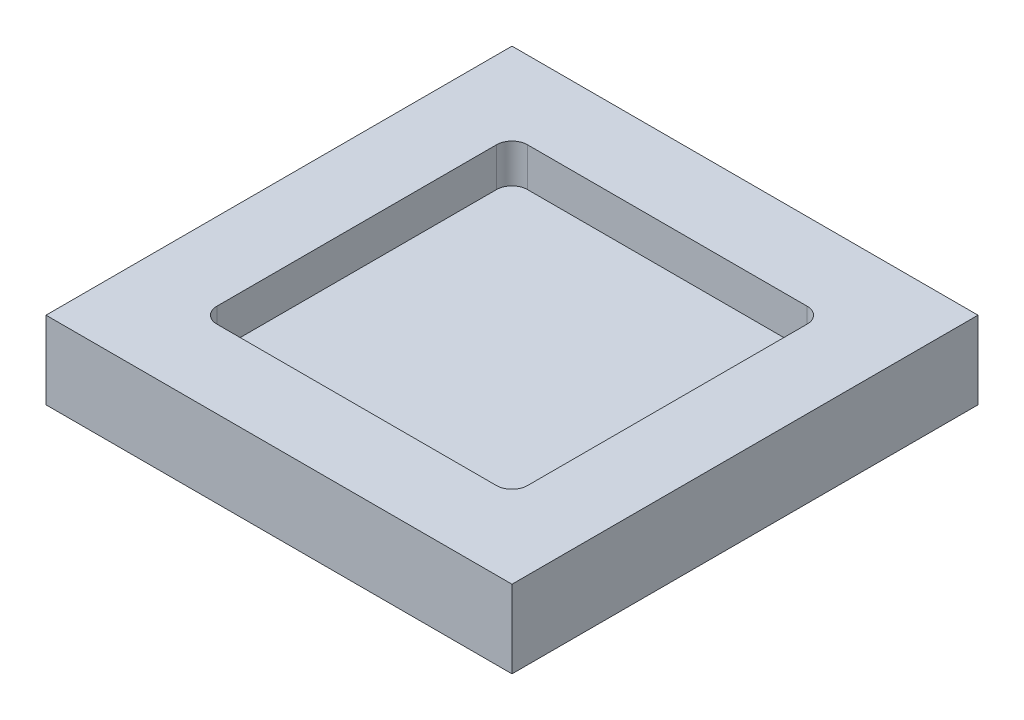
from build123d import *

# Parameters (mm, degrees)
SKETCH1_W          = 76.2
SKETCH1_H          = 76.2
EXTRUDE1_DEPTH     = 12.7
SKETCH2_W          = 50.8
SKETCH2_H          = 50.8
CUT_EXTRUDE1_DEPTH = 6.35
FILLET1_R          = 2.54


with BuildPart() as part:
    # Sketch1 → Extrude1 (new body)
    with BuildSketch(Plane(origin=(0, 0, 0), x_dir=(1, 0, 0), z_dir=(0, 1, 0))):
        Rectangle(SKETCH1_W, SKETCH1_H)
    extrude(amount=EXTRUDE1_DEPTH)

    # Sketch2 → Cut-Extrude1 (cut)
    with BuildSketch(Plane(origin=(0, 12.7, 0), x_dir=(-1, 0, 0), z_dir=(0, 1, 0))):
        Rectangle(SKETCH2_W, SKETCH2_H)
    extrude(amount=-CUT_EXTRUDE1_DEPTH, mode=Mode.SUBTRACT)

    # Fillet1
    fillet1_edges = [part.edges().sort_by_distance(p)[0] for p in [
        (-25.4, 9.525, 25.4),
        (-25.4, 9.525, -25.4),
        (25.4, 9.525, -25.4),
        (25.4, 9.525, 25.4),
    ]]
    fillet(fillet1_edges, radius=FILLET1_R)


solid = part.part
